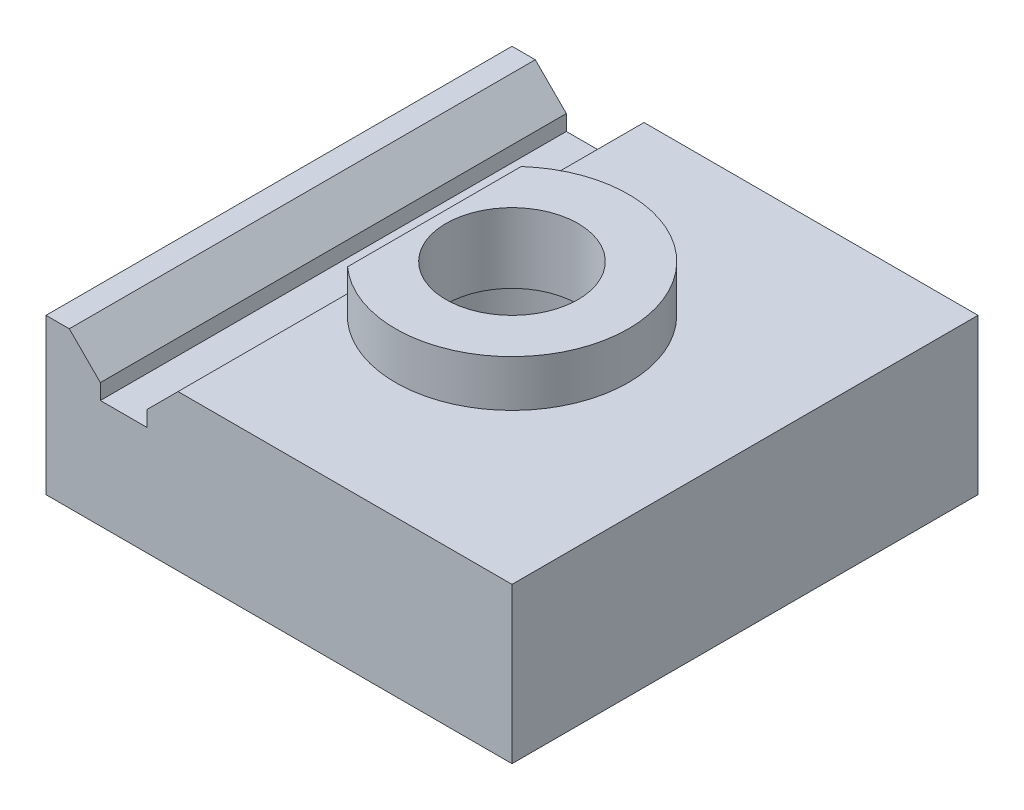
from build123d import *

# Parameters (mm, degrees)
AUFSATZ_LINEAR_AUSTRAGEN1_DEPTH                      = 15
AUFSATZ_LINEAR_AUSTRAGEN3_DEPTH                      = 3
STIRNSENKUNG_F_R_M2_5_ZYLINDERSCHRAUBE_M_D           = 8.5
STIRNSENKUNG_F_R_M2_5_ZYLINDERSCHRAUBE_M_CBORE_D     = 13.5
STIRNSENKUNG_F_R_M2_5_ZYLINDERSCHRAUBE_M_CBORE_DEPTH = 8.5


with BuildPart() as part:
    # Skizze1 → Aufsatz-Linear austragen1 (new, symmetric)
    with BuildSketch(Plane.XY):
        Polygon((-15, 10), (-15, 0), (15, 0), (15, 10), (-6.5, 10), (-8.5, 8), (-8.5, 7), (-11.5, 7), (-11.5, 8), (-13.5, 10), align=None)
    extrude(amount=AUFSATZ_LINEAR_AUSTRAGEN1_DEPTH, both=True)

    # Skizze5 → Aufsatz-Linear austragen3 (add)
    with BuildSketch(Plane(origin=(0, 10, 0), x_dir=(1, 0, 0), z_dir=(0, 1, 0))):
        with BuildLine():
            Line((-5, 5.590169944), (-5, -5.590169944))
            ThreePointArc((-5, -5.590169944), (7.5, 0), (-5, 5.590169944))
        make_face()
    extrude(amount=AUFSATZ_LINEAR_AUSTRAGEN3_DEPTH)

    # Stirnsenkung f_r M2.5 Zylinderschraube m (through all)
    with Locations(Plane.XZ):
        with Locations((0, 0)):
            CounterBoreHole(STIRNSENKUNG_F_R_M2_5_ZYLINDERSCHRAUBE_M_D / 2, STIRNSENKUNG_F_R_M2_5_ZYLINDERSCHRAUBE_M_CBORE_D / 2, STIRNSENKUNG_F_R_M2_5_ZYLINDERSCHRAUBE_M_CBORE_DEPTH)


solid = part.part
